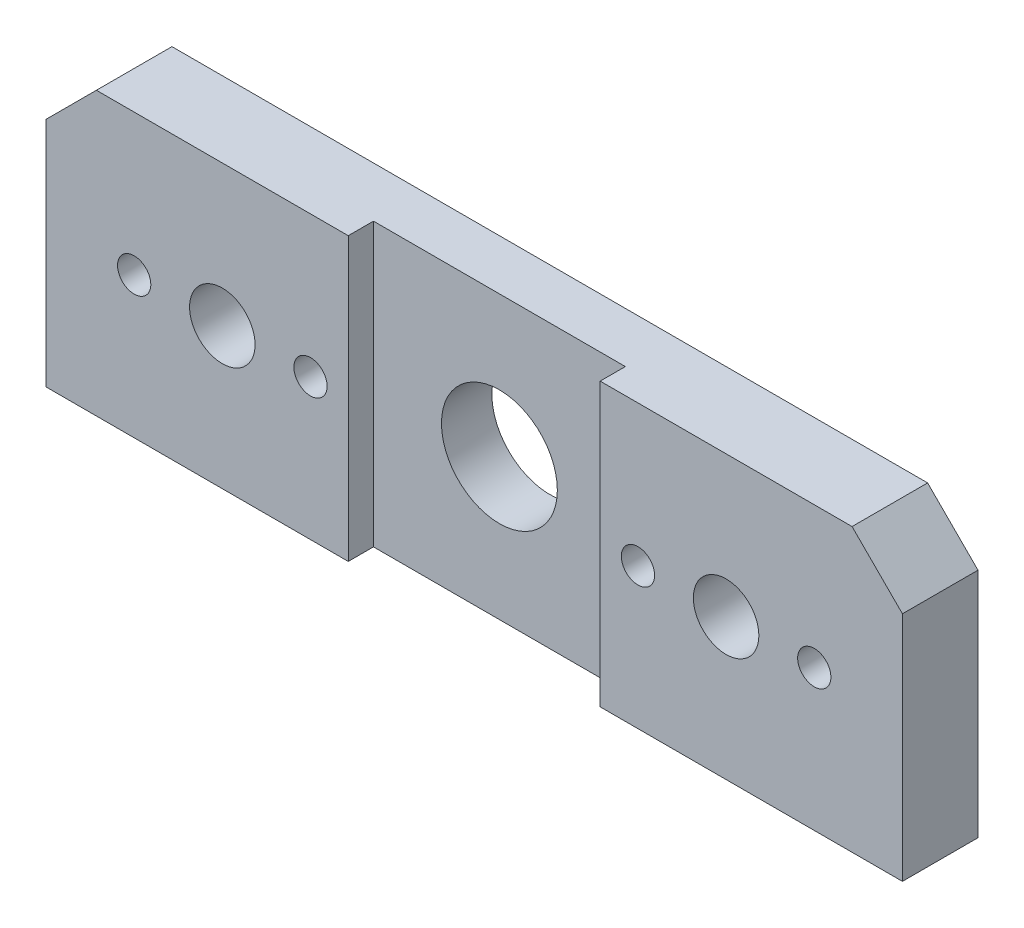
ISO-10303-21;
HEADER;
FILE_DESCRIPTION(('STEP AP214'),'2;1');
FILE_NAME('part.step','',(''),(''),'','','');
FILE_SCHEMA(('AUTOMOTIVE_DESIGN { 1 0 10303 214 1 1 1 1 }'));
ENDSEC;
DATA;
#1=APPLICATION_CONTEXT('core data for automotive mechanical design processes');
#2=APPLICATION_PROTOCOL_DEFINITION('international standard','automotive_design',2000,#1);
#3=PRODUCT_CONTEXT('',#1,'mechanical');
#4=PRODUCT('Part','Part','',(#3));
#5=PRODUCT_RELATED_PRODUCT_CATEGORY('part','',(#4));
#6=PRODUCT_DEFINITION_FORMATION('','',#4);
#7=PRODUCT_DEFINITION_CONTEXT('part definition',#1,'design');
#8=PRODUCT_DEFINITION('design','',#6,#7);
#9=PRODUCT_DEFINITION_SHAPE('','',#8);
#10=(LENGTH_UNIT() NAMED_UNIT(*) SI_UNIT(.MILLI.,.METRE.));
#11=(NAMED_UNIT(*) PLANE_ANGLE_UNIT() SI_UNIT($,.RADIAN.));
#12=(NAMED_UNIT(*) SI_UNIT($,.STERADIAN.) SOLID_ANGLE_UNIT());
#13=UNCERTAINTY_MEASURE_WITH_UNIT(LENGTH_MEASURE(1.E-05),#10,'distance_accuracy_value','');
#14=(GEOMETRIC_REPRESENTATION_CONTEXT(3) GLOBAL_UNCERTAINTY_ASSIGNED_CONTEXT((#13)) GLOBAL_UNIT_ASSIGNED_CONTEXT((#10,
#11,#12)) REPRESENTATION_CONTEXT('',''));
#15=CARTESIAN_POINT('',(0.,0.,0.));
#16=DIRECTION('',(0.,0.,1.));
#17=DIRECTION('',(1.,0.,0.));
#18=AXIS2_PLACEMENT_3D('',#15,#16,#17);
#19=CARTESIAN_POINT('',(-85.,56.,15.));
#20=DIRECTION('',(0.,0.,-1.));
#21=DIRECTION('',(-1.,0.,0.));
#22=AXIS2_PLACEMENT_3D('',#19,#20,#21);
#23=PLANE('',#22);
#24=CARTESIAN_POINT('',(-32.5,28.,15.));
#25=DIRECTION('',(0.,0.,-1.));
#26=DIRECTION('',(-1.,0.,0.));
#27=AXIS2_PLACEMENT_3D('',#24,#25,#26);
#28=CIRCLE('',#27,3.3);
#29=CARTESIAN_POINT('',(-35.8,28.,15.));
#30=VERTEX_POINT('',#29);
#31=EDGE_CURVE('E444',#30,#30,#28,.T.);
#32=ORIENTED_EDGE('',*,*,#31,.T.);
#33=EDGE_LOOP('',(#32));
#34=FACE_BOUND('',#33,.T.);
#35=CARTESIAN_POINT('',(-67.5,28.,15.));
#36=DIRECTION('',(0.,0.,-1.));
#37=DIRECTION('',(-1.,0.,0.));
#38=AXIS2_PLACEMENT_3D('',#35,#36,#37);
#39=CIRCLE('',#38,3.3);
#40=CARTESIAN_POINT('',(-70.8,28.,15.));
#41=VERTEX_POINT('',#40);
#42=EDGE_CURVE('E432',#41,#41,#39,.T.);
#43=ORIENTED_EDGE('',*,*,#42,.T.);
#44=EDGE_LOOP('',(#43));
#45=FACE_BOUND('',#44,.T.);
#46=CARTESIAN_POINT('',(-50.,28.,15.));
#47=DIRECTION('',(0.,0.,1.));
#48=DIRECTION('',(1.,0.,0.));
#49=AXIS2_PLACEMENT_3D('',#46,#47,#48);
#50=CIRCLE('',#49,6.5);
#51=CARTESIAN_POINT('',(-43.5,28.,15.));
#52=VERTEX_POINT('',#51);
#53=EDGE_CURVE('E418',#52,#52,#50,.T.);
#54=ORIENTED_EDGE('',*,*,#53,.F.);
#55=EDGE_LOOP('',(#54));
#56=FACE_BOUND('',#55,.T.);
#57=DIRECTION('',(1.,0.,0.));
#58=VECTOR('',#57,1.);
#59=CARTESIAN_POINT('',(-85.,0.,15.));
#60=LINE('',#59,#58);
#61=CARTESIAN_POINT('',(-85.,0.,15.));
#62=VERTEX_POINT('',#61);
#63=CARTESIAN_POINT('',(-25.,0.,15.));
#64=VERTEX_POINT('',#63);
#65=EDGE_CURVE('E386',#62,#64,#60,.T.);
#66=ORIENTED_EDGE('',*,*,#65,.T.);
#67=DIRECTION('',(0.,1.,0.));
#68=VECTOR('',#67,1.);
#69=CARTESIAN_POINT('',(-25.,56.,15.));
#70=LINE('',#69,#68);
#71=CARTESIAN_POINT('',(-25.,56.,15.));
#72=VERTEX_POINT('',#71);
#73=EDGE_CURVE('E228',#64,#72,#70,.T.);
#74=ORIENTED_EDGE('',*,*,#73,.T.);
#75=DIRECTION('',(-1.,0.,0.));
#76=VECTOR('',#75,1.);
#77=CARTESIAN_POINT('',(-85.,56.,15.));
#78=LINE('',#77,#76);
#79=CARTESIAN_POINT('',(-75.,56.,15.));
#80=VERTEX_POINT('',#79);
#81=EDGE_CURVE('E200',#72,#80,#78,.T.);
#82=ORIENTED_EDGE('',*,*,#81,.T.);
#83=DIRECTION('',(0.707106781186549,0.707106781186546,0.));
#84=VECTOR('',#83,1.);
#85=CARTESIAN_POINT('',(-85.,46.,15.));
#86=LINE('',#85,#84);
#87=CARTESIAN_POINT('',(-85.,46.,15.));
#88=VERTEX_POINT('',#87);
#89=EDGE_CURVE('E224',#80,#88,#86,.F.);
#90=ORIENTED_EDGE('',*,*,#89,.T.);
#91=DIRECTION('',(0.,-1.,0.));
#92=VECTOR('',#91,1.);
#93=CARTESIAN_POINT('',(-85.,0.,15.));
#94=LINE('',#93,#92);
#95=EDGE_CURVE('E384',#88,#62,#94,.T.);
#96=ORIENTED_EDGE('',*,*,#95,.T.);
#97=EDGE_LOOP('',(#66,#74,#82,#90,#96));
#98=FACE_BOUND('',#97,.T.);
#99=ADVANCED_FACE('F33',(#34,#45,#56,#98),#23,.F.);
#100=CARTESIAN_POINT('',(-85.,0.,15.));
#101=DIRECTION('',(1.,0.,0.));
#102=DIRECTION('',(0.,0.,-1.));
#103=AXIS2_PLACEMENT_3D('',#100,#101,#102);
#104=PLANE('',#103);
#105=ORIENTED_EDGE('',*,*,#95,.F.);
#106=DIRECTION('',(0.,0.,-1.));
#107=VECTOR('',#106,1.);
#108=CARTESIAN_POINT('',(-85.,46.,15.));
#109=LINE('',#108,#107);
#110=CARTESIAN_POINT('',(-85.,46.,0.));
#111=VERTEX_POINT('',#110);
#112=EDGE_CURVE('E211',#88,#111,#109,.T.);
#113=ORIENTED_EDGE('',*,*,#112,.T.);
#114=DIRECTION('',(0.,-1.,0.));
#115=VECTOR('',#114,1.);
#116=CARTESIAN_POINT('',(-85.,0.,0.));
#117=LINE('',#116,#115);
#118=CARTESIAN_POINT('',(-85.,0.,0.));
#119=VERTEX_POINT('',#118);
#120=EDGE_CURVE('E374',#111,#119,#117,.T.);
#121=ORIENTED_EDGE('',*,*,#120,.T.);
#122=DIRECTION('',(0.,0.,-1.));
#123=VECTOR('',#122,1.);
#124=CARTESIAN_POINT('',(-85.,0.,15.));
#125=LINE('',#124,#123);
#126=EDGE_CURVE('E203',#62,#119,#125,.T.);
#127=ORIENTED_EDGE('',*,*,#126,.F.);
#128=EDGE_LOOP('',(#105,#113,#121,#127));
#129=FACE_BOUND('',#128,.T.);
#130=ADVANCED_FACE('F35',(#129),#104,.F.);
#131=CARTESIAN_POINT('',(-85.,0.,15.));
#132=DIRECTION('',(0.,1.,0.));
#133=DIRECTION('',(0.,0.,1.));
#134=AXIS2_PLACEMENT_3D('',#131,#132,#133);
#135=PLANE('',#134);
#136=CARTESIAN_POINT('',(73.,0.,7.5));
#137=DIRECTION('',(0.,-1.,0.));
#138=DIRECTION('',(0.,0.,-1.));
#139=AXIS2_PLACEMENT_3D('',#136,#137,#138);
#140=CIRCLE('',#139,2.4);
#141=CARTESIAN_POINT('',(73.,0.,5.1));
#142=VERTEX_POINT('',#141);
#143=EDGE_CURVE('E339',#142,#142,#140,.T.);
#144=ORIENTED_EDGE('',*,*,#143,.F.);
#145=EDGE_LOOP('',(#144));
#146=FACE_BOUND('',#145,.T.);
#147=CARTESIAN_POINT('',(-73.,0.,7.49999999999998));
#148=DIRECTION('',(0.,-1.,0.));
#149=DIRECTION('',(0.,0.,-1.));
#150=AXIS2_PLACEMENT_3D('',#147,#148,#149);
#151=CIRCLE('',#150,2.4);
#152=CARTESIAN_POINT('',(-73.,0.,5.09999999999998));
#153=VERTEX_POINT('',#152);
#154=EDGE_CURVE('E321',#153,#153,#151,.T.);
#155=ORIENTED_EDGE('',*,*,#154,.F.);
#156=EDGE_LOOP('',(#155));
#157=FACE_BOUND('',#156,.T.);
#158=DIRECTION('',(1.,0.,0.));
#159=VECTOR('',#158,1.);
#160=CARTESIAN_POINT('',(-25.,0.,10.));
#161=LINE('',#160,#159);
#162=CARTESIAN_POINT('',(-25.,0.,10.));
#163=VERTEX_POINT('',#162);
#164=CARTESIAN_POINT('',(25.,0.,10.));
#165=VERTEX_POINT('',#164);
#166=EDGE_CURVE('E352',#163,#165,#161,.T.);
#167=ORIENTED_EDGE('',*,*,#166,.F.);
#168=DIRECTION('',(0.,0.,1.));
#169=VECTOR('',#168,1.);
#170=CARTESIAN_POINT('',(-25.,0.,10.));
#171=LINE('',#170,#169);
#172=EDGE_CURVE('E355',#163,#64,#171,.T.);
#173=ORIENTED_EDGE('',*,*,#172,.T.);
#174=ORIENTED_EDGE('',*,*,#65,.F.);
#175=ORIENTED_EDGE('',*,*,#126,.T.);
#176=DIRECTION('',(1.,0.,0.));
#177=VECTOR('',#176,1.);
#178=CARTESIAN_POINT('',(-85.,0.,0.));
#179=LINE('',#178,#177);
#180=CARTESIAN_POINT('',(85.,0.,0.));
#181=VERTEX_POINT('',#180);
#182=EDGE_CURVE('E376',#119,#181,#179,.T.);
#183=ORIENTED_EDGE('',*,*,#182,.T.);
#184=DIRECTION('',(0.,0.,-1.));
#185=VECTOR('',#184,1.);
#186=CARTESIAN_POINT('',(85.,0.,15.));
#187=LINE('',#186,#185);
#188=CARTESIAN_POINT('',(85.,0.,15.));
#189=VERTEX_POINT('',#188);
#190=EDGE_CURVE('E199',#189,#181,#187,.T.);
#191=ORIENTED_EDGE('',*,*,#190,.F.);
#192=CARTESIAN_POINT('',(25.,0.,15.));
#193=VERTEX_POINT('',#192);
#194=EDGE_CURVE('E385',#193,#189,#60,.T.);
#195=ORIENTED_EDGE('',*,*,#194,.F.);
#196=DIRECTION('',(0.,0.,1.));
#197=VECTOR('',#196,1.);
#198=CARTESIAN_POINT('',(25.,0.,10.));
#199=LINE('',#198,#197);
#200=EDGE_CURVE('E357',#165,#193,#199,.T.);
#201=ORIENTED_EDGE('',*,*,#200,.F.);
#202=EDGE_LOOP('',(#167,#173,#174,#175,#183,#191,#195,#201));
#203=FACE_BOUND('',#202,.T.);
#204=ADVANCED_FACE('F157',(#146,#157,#203),#135,.F.);
#205=CARTESIAN_POINT('',(85.,0.,15.));
#206=DIRECTION('',(-1.,0.,0.));
#207=DIRECTION('',(0.,-1.,0.));
#208=AXIS2_PLACEMENT_3D('',#205,#206,#207);
#209=PLANE('',#208);
#210=DIRECTION('',(0.,1.,0.));
#211=VECTOR('',#210,1.);
#212=CARTESIAN_POINT('',(85.,0.,0.));
#213=LINE('',#212,#211);
#214=CARTESIAN_POINT('',(85.,46.,0.));
#215=VERTEX_POINT('',#214);
#216=EDGE_CURVE('E378',#181,#215,#213,.T.);
#217=ORIENTED_EDGE('',*,*,#216,.T.);
#218=DIRECTION('',(0.,0.,1.));
#219=VECTOR('',#218,1.);
#220=CARTESIAN_POINT('',(85.,46.,15.));
#221=LINE('',#220,#219);
#222=CARTESIAN_POINT('',(85.,46.,15.));
#223=VERTEX_POINT('',#222);
#224=EDGE_CURVE('E226',#215,#223,#221,.T.);
#225=ORIENTED_EDGE('',*,*,#224,.T.);
#226=DIRECTION('',(0.,1.,0.));
#227=VECTOR('',#226,1.);
#228=CARTESIAN_POINT('',(85.,0.,15.));
#229=LINE('',#228,#227);
#230=EDGE_CURVE('E205',#189,#223,#229,.T.);
#231=ORIENTED_EDGE('',*,*,#230,.F.);
#232=ORIENTED_EDGE('',*,*,#190,.T.);
#233=EDGE_LOOP('',(#217,#225,#231,#232));
#234=FACE_BOUND('',#233,.T.);
#235=ADVANCED_FACE('F173',(#234),#209,.F.);
#236=CARTESIAN_POINT('',(-85.,56.,15.));
#237=DIRECTION('',(0.,-1.,0.));
#238=DIRECTION('',(0.,0.,-1.));
#239=AXIS2_PLACEMENT_3D('',#236,#237,#238);
#240=PLANE('',#239);
#241=ORIENTED_EDGE('',*,*,#81,.F.);
#242=DIRECTION('',(0.,0.,-1.));
#243=VECTOR('',#242,1.);
#244=CARTESIAN_POINT('',(-25.,56.,15.));
#245=LINE('',#244,#243);
#246=CARTESIAN_POINT('',(-25.,56.,10.));
#247=VERTEX_POINT('',#246);
#248=EDGE_CURVE('E371',#72,#247,#245,.T.);
#249=ORIENTED_EDGE('',*,*,#248,.T.);
#250=DIRECTION('',(1.,0.,0.));
#251=VECTOR('',#250,1.);
#252=CARTESIAN_POINT('',(-85.,56.,10.));
#253=LINE('',#252,#251);
#254=CARTESIAN_POINT('',(25.,56.,10.));
#255=VERTEX_POINT('',#254);
#256=EDGE_CURVE('E231',#247,#255,#253,.T.);
#257=ORIENTED_EDGE('',*,*,#256,.T.);
#258=DIRECTION('',(0.,0.,1.));
#259=VECTOR('',#258,1.);
#260=CARTESIAN_POINT('',(25.,56.,15.));
#261=LINE('',#260,#259);
#262=CARTESIAN_POINT('',(25.,56.,15.));
#263=VERTEX_POINT('',#262);
#264=EDGE_CURVE('E368',#255,#263,#261,.T.);
#265=ORIENTED_EDGE('',*,*,#264,.T.);
#266=CARTESIAN_POINT('',(75.,56.,15.));
#267=VERTEX_POINT('',#266);
#268=EDGE_CURVE('E190',#267,#263,#78,.T.);
#269=ORIENTED_EDGE('',*,*,#268,.F.);
#270=DIRECTION('',(0.,0.,-1.));
#271=VECTOR('',#270,1.);
#272=CARTESIAN_POINT('',(75.,56.,15.));
#273=LINE('',#272,#271);
#274=CARTESIAN_POINT('',(75.,56.,0.));
#275=VERTEX_POINT('',#274);
#276=EDGE_CURVE('E218',#267,#275,#273,.T.);
#277=ORIENTED_EDGE('',*,*,#276,.T.);
#278=DIRECTION('',(-1.,0.,0.));
#279=VECTOR('',#278,1.);
#280=CARTESIAN_POINT('',(-85.,56.,0.));
#281=LINE('',#280,#279);
#282=CARTESIAN_POINT('',(-75.,56.,0.));
#283=VERTEX_POINT('',#282);
#284=EDGE_CURVE('E381',#275,#283,#281,.T.);
#285=ORIENTED_EDGE('',*,*,#284,.T.);
#286=DIRECTION('',(0.,0.,1.));
#287=VECTOR('',#286,1.);
#288=CARTESIAN_POINT('',(-75.,56.,15.));
#289=LINE('',#288,#287);
#290=EDGE_CURVE('E220',#283,#80,#289,.T.);
#291=ORIENTED_EDGE('',*,*,#290,.T.);
#292=EDGE_LOOP('',(#241,#249,#257,#265,#269,#277,#285,#291));
#293=FACE_BOUND('',#292,.T.);
#294=ADVANCED_FACE('F165',(#293),#240,.F.);
#295=CARTESIAN_POINT('',(32.5,28.,15.));
#296=DIRECTION('',(0.,0.,-1.));
#297=DIRECTION('',(-1.,0.,0.));
#298=AXIS2_PLACEMENT_3D('',#295,#296,#297);
#299=CIRCLE('',#298,3.3);
#300=CARTESIAN_POINT('',(29.2,28.,15.));
#301=VERTEX_POINT('',#300);
#302=EDGE_CURVE('E178',#301,#301,#299,.T.);
#303=ORIENTED_EDGE('',*,*,#302,.T.);
#304=EDGE_LOOP('',(#303));
#305=FACE_BOUND('',#304,.T.);
#306=CARTESIAN_POINT('',(67.5,28.,15.));
#307=DIRECTION('',(0.,0.,-1.));
#308=DIRECTION('',(-1.,0.,0.));
#309=AXIS2_PLACEMENT_3D('',#306,#307,#308);
#310=CIRCLE('',#309,3.3);
#311=CARTESIAN_POINT('',(64.2,28.,15.));
#312=VERTEX_POINT('',#311);
#313=EDGE_CURVE('E182',#312,#312,#310,.T.);
#314=ORIENTED_EDGE('',*,*,#313,.T.);
#315=EDGE_LOOP('',(#314));
#316=FACE_BOUND('',#315,.T.);
#317=CARTESIAN_POINT('',(50.,28.,15.));
#318=DIRECTION('',(0.,0.,1.));
#319=DIRECTION('',(1.,0.,0.));
#320=AXIS2_PLACEMENT_3D('',#317,#318,#319);
#321=CIRCLE('',#320,6.5);
#322=CARTESIAN_POINT('',(56.5,28.,15.));
#323=VERTEX_POINT('',#322);
#324=EDGE_CURVE('E186',#323,#323,#321,.T.);
#325=ORIENTED_EDGE('',*,*,#324,.F.);
#326=EDGE_LOOP('',(#325));
#327=FACE_BOUND('',#326,.T.);
#328=ORIENTED_EDGE('',*,*,#268,.T.);
#329=DIRECTION('',(0.,1.,0.));
#330=VECTOR('',#329,1.);
#331=CARTESIAN_POINT('',(25.,0.,15.));
#332=LINE('',#331,#330);
#333=EDGE_CURVE('E191',#193,#263,#332,.T.);
#334=ORIENTED_EDGE('',*,*,#333,.F.);
#335=ORIENTED_EDGE('',*,*,#194,.T.);
#336=ORIENTED_EDGE('',*,*,#230,.T.);
#337=DIRECTION('',(0.707106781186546,-0.707106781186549,0.));
#338=VECTOR('',#337,1.);
#339=CARTESIAN_POINT('',(75.,56.,15.));
#340=LINE('',#339,#338);
#341=EDGE_CURVE('E195',#223,#267,#340,.F.);
#342=ORIENTED_EDGE('',*,*,#341,.T.);
#343=EDGE_LOOP('',(#328,#334,#335,#336,#342));
#344=FACE_BOUND('',#343,.T.);
#345=ADVANCED_FACE('F153',(#305,#316,#327,#344),#23,.F.);
#346=CARTESIAN_POINT('',(-85.,56.,0.));
#347=DIRECTION('',(0.,0.,-1.));
#348=DIRECTION('',(-1.,0.,0.));
#349=AXIS2_PLACEMENT_3D('',#346,#347,#348);
#350=PLANE('',#349);
#351=CARTESIAN_POINT('',(32.5,28.,0.));
#352=DIRECTION('',(0.,0.,-1.));
#353=DIRECTION('',(-1.,0.,0.));
#354=AXIS2_PLACEMENT_3D('',#351,#352,#353);
#355=CIRCLE('',#354,6.);
#356=CARTESIAN_POINT('',(26.5,28.,0.));
#357=VERTEX_POINT('',#356);
#358=EDGE_CURVE('E455',#357,#357,#355,.T.);
#359=ORIENTED_EDGE('',*,*,#358,.F.);
#360=EDGE_LOOP('',(#359));
#361=FACE_BOUND('',#360,.T.);
#362=CARTESIAN_POINT('',(67.5,28.,0.));
#363=DIRECTION('',(0.,0.,-1.));
#364=DIRECTION('',(-1.,0.,0.));
#365=AXIS2_PLACEMENT_3D('',#362,#363,#364);
#366=CIRCLE('',#365,6.00000000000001);
#367=CARTESIAN_POINT('',(61.5,28.,0.));
#368=VERTEX_POINT('',#367);
#369=EDGE_CURVE('E446',#368,#368,#366,.T.);
#370=ORIENTED_EDGE('',*,*,#369,.F.);
#371=EDGE_LOOP('',(#370));
#372=FACE_BOUND('',#371,.T.);
#373=CARTESIAN_POINT('',(-32.5,28.,0.));
#374=DIRECTION('',(0.,0.,-1.));
#375=DIRECTION('',(-1.,0.,0.));
#376=AXIS2_PLACEMENT_3D('',#373,#374,#375);
#377=CIRCLE('',#376,6.);
#378=CARTESIAN_POINT('',(-38.5,28.,0.));
#379=VERTEX_POINT('',#378);
#380=EDGE_CURVE('E435',#379,#379,#377,.T.);
#381=ORIENTED_EDGE('',*,*,#380,.F.);
#382=EDGE_LOOP('',(#381));
#383=FACE_BOUND('',#382,.T.);
#384=CARTESIAN_POINT('',(-67.5,28.,0.));
#385=DIRECTION('',(0.,0.,-1.));
#386=DIRECTION('',(-1.,0.,0.));
#387=AXIS2_PLACEMENT_3D('',#384,#385,#386);
#388=CIRCLE('',#387,6.);
#389=CARTESIAN_POINT('',(-73.5,28.,0.));
#390=VERTEX_POINT('',#389);
#391=EDGE_CURVE('E425',#390,#390,#388,.T.);
#392=ORIENTED_EDGE('',*,*,#391,.F.);
#393=EDGE_LOOP('',(#392));
#394=FACE_BOUND('',#393,.T.);
#395=CARTESIAN_POINT('',(50.,28.,0.));
#396=DIRECTION('',(0.,0.,1.));
#397=DIRECTION('',(1.,0.,0.));
#398=AXIS2_PLACEMENT_3D('',#395,#396,#397);
#399=CIRCLE('',#398,6.5);
#400=CARTESIAN_POINT('',(56.5,28.,0.));
#401=VERTEX_POINT('',#400);
#402=EDGE_CURVE('E421',#401,#401,#399,.T.);
#403=ORIENTED_EDGE('',*,*,#402,.T.);
#404=EDGE_LOOP('',(#403));
#405=FACE_BOUND('',#404,.T.);
#406=CARTESIAN_POINT('',(-50.,28.,0.));
#407=DIRECTION('',(0.,0.,1.));
#408=DIRECTION('',(1.,0.,0.));
#409=AXIS2_PLACEMENT_3D('',#406,#407,#408);
#410=CIRCLE('',#409,6.5);
#411=CARTESIAN_POINT('',(-43.5,28.,0.));
#412=VERTEX_POINT('',#411);
#413=EDGE_CURVE('E415',#412,#412,#410,.T.);
#414=ORIENTED_EDGE('',*,*,#413,.T.);
#415=EDGE_LOOP('',(#414));
#416=FACE_BOUND('',#415,.T.);
#417=CARTESIAN_POINT('',(0.,28.,0.));
#418=DIRECTION('',(0.,0.,1.));
#419=DIRECTION('',(1.,0.,0.));
#420=AXIS2_PLACEMENT_3D('',#417,#418,#419);
#421=CIRCLE('',#420,11.5);
#422=CARTESIAN_POINT('',(11.5,28.,0.));
#423=VERTEX_POINT('',#422);
#424=EDGE_CURVE('E238',#423,#423,#421,.T.);
#425=ORIENTED_EDGE('',*,*,#424,.T.);
#426=EDGE_LOOP('',(#425));
#427=FACE_BOUND('',#426,.T.);
#428=ORIENTED_EDGE('',*,*,#120,.F.);
#429=DIRECTION('',(-0.707106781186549,-0.707106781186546,0.));
#430=VECTOR('',#429,1.);
#431=CARTESIAN_POINT('',(-80.,51.,0.));
#432=LINE('',#431,#430);
#433=EDGE_CURVE('E216',#111,#283,#432,.F.);
#434=ORIENTED_EDGE('',*,*,#433,.T.);
#435=ORIENTED_EDGE('',*,*,#284,.F.);
#436=DIRECTION('',(-0.707106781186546,0.707106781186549,0.));
#437=VECTOR('',#436,1.);
#438=CARTESIAN_POINT('',(-4.9999999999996,136.,0.));
#439=LINE('',#438,#437);
#440=EDGE_CURVE('E214',#275,#215,#439,.F.);
#441=ORIENTED_EDGE('',*,*,#440,.T.);
#442=ORIENTED_EDGE('',*,*,#216,.F.);
#443=ORIENTED_EDGE('',*,*,#182,.F.);
#444=EDGE_LOOP('',(#428,#434,#435,#441,#442,#443));
#445=FACE_BOUND('',#444,.T.);
#446=ADVANCED_FACE('F164',(#361,#372,#383,#394,#405,#416,#427,#445),#350,.T.);
#447=CARTESIAN_POINT('',(-85.,46.,15.));
#448=DIRECTION('',(0.707106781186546,-0.707106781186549,0.));
#449=DIRECTION('',(0.707106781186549,0.707106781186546,0.));
#450=AXIS2_PLACEMENT_3D('',#447,#448,#449);
#451=PLANE('',#450);
#452=ORIENTED_EDGE('',*,*,#89,.F.);
#453=ORIENTED_EDGE('',*,*,#290,.F.);
#454=ORIENTED_EDGE('',*,*,#433,.F.);
#455=ORIENTED_EDGE('',*,*,#112,.F.);
#456=EDGE_LOOP('',(#452,#453,#454,#455));
#457=FACE_BOUND('',#456,.T.);
#458=ADVANCED_FACE('F171',(#457),#451,.F.);
#459=CARTESIAN_POINT('',(75.,56.,15.));
#460=DIRECTION('',(-0.707106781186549,-0.707106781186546,0.));
#461=DIRECTION('',(0.707106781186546,-0.707106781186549,0.));
#462=AXIS2_PLACEMENT_3D('',#459,#460,#461);
#463=PLANE('',#462);
#464=ORIENTED_EDGE('',*,*,#341,.F.);
#465=ORIENTED_EDGE('',*,*,#224,.F.);
#466=ORIENTED_EDGE('',*,*,#440,.F.);
#467=ORIENTED_EDGE('',*,*,#276,.F.);
#468=EDGE_LOOP('',(#464,#465,#466,#467));
#469=FACE_BOUND('',#468,.T.);
#470=ADVANCED_FACE('F395',(#469),#463,.F.);
#471=CARTESIAN_POINT('',(-25.,84.0864618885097,10.));
#472=DIRECTION('',(0.,0.,-1.));
#473=DIRECTION('',(-1.,0.,0.));
#474=AXIS2_PLACEMENT_3D('',#471,#472,#473);
#475=PLANE('',#474);
#476=CARTESIAN_POINT('',(0.,28.,10.));
#477=DIRECTION('',(0.,0.,-1.));
#478=DIRECTION('',(-1.,0.,0.));
#479=AXIS2_PLACEMENT_3D('',#476,#477,#478);
#480=CIRCLE('',#479,11.5);
#481=CARTESIAN_POINT('',(-11.5,28.,10.));
#482=VERTEX_POINT('',#481);
#483=EDGE_CURVE('E235',#482,#482,#480,.T.);
#484=ORIENTED_EDGE('',*,*,#483,.T.);
#485=EDGE_LOOP('',(#484));
#486=FACE_BOUND('',#485,.T.);
#487=DIRECTION('',(0.,-1.,0.));
#488=VECTOR('',#487,1.);
#489=CARTESIAN_POINT('',(-25.,0.,10.));
#490=LINE('',#489,#488);
#491=EDGE_CURVE('E361',#247,#163,#490,.T.);
#492=ORIENTED_EDGE('',*,*,#491,.T.);
#493=ORIENTED_EDGE('',*,*,#166,.T.);
#494=DIRECTION('',(0.,1.,0.));
#495=VECTOR('',#494,1.);
#496=CARTESIAN_POINT('',(25.,0.,10.));
#497=LINE('',#496,#495);
#498=EDGE_CURVE('E360',#165,#255,#497,.T.);
#499=ORIENTED_EDGE('',*,*,#498,.T.);
#500=ORIENTED_EDGE('',*,*,#256,.F.);
#501=EDGE_LOOP('',(#492,#493,#499,#500));
#502=FACE_BOUND('',#501,.T.);
#503=ADVANCED_FACE('F409',(#486,#502),#475,.F.);
#504=CARTESIAN_POINT('',(-25.,0.,10.));
#505=DIRECTION('',(-1.,0.,0.));
#506=DIRECTION('',(0.,0.,1.));
#507=AXIS2_PLACEMENT_3D('',#504,#505,#506);
#508=PLANE('',#507);
#509=ORIENTED_EDGE('',*,*,#73,.F.);
#510=ORIENTED_EDGE('',*,*,#172,.F.);
#511=ORIENTED_EDGE('',*,*,#491,.F.);
#512=ORIENTED_EDGE('',*,*,#248,.F.);
#513=EDGE_LOOP('',(#509,#510,#511,#512));
#514=FACE_BOUND('',#513,.T.);
#515=ADVANCED_FACE('F408',(#514),#508,.F.);
#516=CARTESIAN_POINT('',(25.,0.,10.));
#517=DIRECTION('',(1.,0.,0.));
#518=DIRECTION('',(0.,1.,0.));
#519=AXIS2_PLACEMENT_3D('',#516,#517,#518);
#520=PLANE('',#519);
#521=ORIENTED_EDGE('',*,*,#498,.F.);
#522=ORIENTED_EDGE('',*,*,#200,.T.);
#523=ORIENTED_EDGE('',*,*,#333,.T.);
#524=ORIENTED_EDGE('',*,*,#264,.F.);
#525=EDGE_LOOP('',(#521,#522,#523,#524));
#526=FACE_BOUND('',#525,.T.);
#527=ADVANCED_FACE('F411',(#526),#520,.F.);
#528=CARTESIAN_POINT('',(0.,28.,0.));
#529=DIRECTION('',(0.,0.,1.));
#530=DIRECTION('',(1.,0.,0.));
#531=AXIS2_PLACEMENT_3D('',#528,#529,#530);
#532=CYLINDRICAL_SURFACE('',#531,11.5);
#533=ORIENTED_EDGE('',*,*,#424,.F.);
#534=EDGE_LOOP('',(#533));
#535=FACE_BOUND('',#534,.T.);
#536=ORIENTED_EDGE('',*,*,#483,.F.);
#537=EDGE_LOOP('',(#536));
#538=FACE_BOUND('',#537,.T.);
#539=ADVANCED_FACE('F481',(#535,#538),#532,.F.);
#540=CARTESIAN_POINT('',(-50.,28.,0.));
#541=DIRECTION('',(0.,0.,1.));
#542=DIRECTION('',(1.,0.,0.));
#543=AXIS2_PLACEMENT_3D('',#540,#541,#542);
#544=CYLINDRICAL_SURFACE('',#543,6.5);
#545=ORIENTED_EDGE('',*,*,#413,.F.);
#546=EDGE_LOOP('',(#545));
#547=FACE_BOUND('',#546,.T.);
#548=ORIENTED_EDGE('',*,*,#53,.T.);
#549=EDGE_LOOP('',(#548));
#550=FACE_BOUND('',#549,.T.);
#551=ADVANCED_FACE('F484',(#547,#550),#544,.F.);
#552=CARTESIAN_POINT('',(50.,28.,0.));
#553=DIRECTION('',(0.,0.,1.));
#554=DIRECTION('',(1.,0.,0.));
#555=AXIS2_PLACEMENT_3D('',#552,#553,#554);
#556=CYLINDRICAL_SURFACE('',#555,6.5);
#557=ORIENTED_EDGE('',*,*,#402,.F.);
#558=EDGE_LOOP('',(#557));
#559=FACE_BOUND('',#558,.T.);
#560=ORIENTED_EDGE('',*,*,#324,.T.);
#561=EDGE_LOOP('',(#560));
#562=FACE_BOUND('',#561,.T.);
#563=ADVANCED_FACE('F260',(#559,#562),#556,.F.);
#564=CARTESIAN_POINT('',(-67.5,28.,0.));
#565=DIRECTION('',(0.,0.,-1.));
#566=DIRECTION('',(-1.,0.,0.));
#567=AXIS2_PLACEMENT_3D('',#564,#565,#566);
#568=CYLINDRICAL_SURFACE('',#567,6.);
#569=CARTESIAN_POINT('',(-71.4797475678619,23.5098319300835,7.19020000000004));
#570=CARTESIAN_POINT('',(-71.4670544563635,23.4985778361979,7.15880173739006));
#571=CARTESIAN_POINT('',(-71.4529729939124,23.4861964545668,7.12845375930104));
#572=CARTESIAN_POINT('',(-71.4225549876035,23.4597404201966,7.06980220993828));
#573=CARTESIAN_POINT('',(-71.4062250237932,23.4456707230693,7.04149302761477));
#574=CARTESIAN_POINT('',(-71.3717385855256,23.4163162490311,6.98666100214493));
#575=CARTESIAN_POINT('',(-71.3535805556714,23.4010304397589,6.96013971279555));
#576=CARTESIAN_POINT('',(-71.3156989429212,23.3695518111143,6.90877282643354));
#577=CARTESIAN_POINT('',(-71.2959737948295,23.3533580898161,6.88392895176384));
#578=CARTESIAN_POINT('',(-71.2165094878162,23.2890228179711,6.79026353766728));
#579=CARTESIAN_POINT('',(-71.1517416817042,23.2384620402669,6.72726788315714));
#580=CARTESIAN_POINT('',(-71.0128042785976,23.1350494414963,6.61499598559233));
#581=CARTESIAN_POINT('',(-70.9386335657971,23.0821973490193,6.56572137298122));
#582=CARTESIAN_POINT('',(-70.8171472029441,23.0000776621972,6.50273724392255));
#583=CARTESIAN_POINT('',(-70.7728506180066,22.970950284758,6.48302023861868));
#584=CARTESIAN_POINT('',(-70.6820166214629,22.912988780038,6.44976098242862));
#585=CARTESIAN_POINT('',(-70.6354855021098,22.8841540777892,6.4362024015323));
#586=CARTESIAN_POINT('',(-70.5878926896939,22.8555934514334,6.42617696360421));
#587=B_SPLINE_CURVE_WITH_KNOTS('',3,(#569,#570,#571,#572,#573,#574,#575,#576,#577,#578,#579,
#580,#581,#582,#583,#584,#585,#586),.UNSPECIFIED.,.F.,.F.,(4,2,2,2,2,2,2,2,4),(0.,
0.106895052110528,0.213483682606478,0.320163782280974,0.426951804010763,0.735993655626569,
1.04507221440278,1.2144151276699,1.38330634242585),.UNSPECIFIED.);
#588=CARTESIAN_POINT('',(-71.3799977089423,23.423361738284,7.));
#589=VERTEX_POINT('',#588);
#590=CARTESIAN_POINT('',(-70.8166247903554,23.,6.50357002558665));
#591=VERTEX_POINT('',#590);
#592=EDGE_CURVE('E56',#589,#591,#587,.T.);
#593=ORIENTED_EDGE('',*,*,#592,.T.);
#594=CARTESIAN_POINT('',(-70.8166247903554,23.,6.50357002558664));
#595=CARTESIAN_POINT('',(-70.7987500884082,22.9881444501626,6.54272915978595));
#596=CARTESIAN_POINT('',(-70.7818453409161,22.9770679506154,6.58256813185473));
#597=CARTESIAN_POINT('',(-70.7501610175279,22.9565080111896,6.66328453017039));
#598=CARTESIAN_POINT('',(-70.7353730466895,22.9470182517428,6.70415705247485));
#599=CARTESIAN_POINT('',(-70.7079594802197,22.9295699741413,6.78694217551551));
#600=CARTESIAN_POINT('',(-70.6953339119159,22.9216114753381,6.82885478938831));
#601=CARTESIAN_POINT('',(-70.6722915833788,22.9071867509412,6.91372463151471));
#602=CARTESIAN_POINT('',(-70.6618840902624,22.9007267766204,6.9566854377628));
#603=CARTESIAN_POINT('',(-70.6526610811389,22.895029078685,7.));
#604=B_SPLINE_CURVE_WITH_KNOTS('',3,(#594,#595,#596,#597,#598,#599,#600,#601,#602,#603),
.UNSPECIFIED.,.F.,.F.,(4,2,2,2,4),(0.,0.133925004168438,0.267303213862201,0.400683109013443,
0.534609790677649),.UNSPECIFIED.);
#605=CARTESIAN_POINT('',(-70.6526610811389,22.895029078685,7.));
#606=VERTEX_POINT('',#605);
#607=EDGE_CURVE('E270',#591,#606,#604,.T.);
#608=ORIENTED_EDGE('',*,*,#607,.T.);
#609=CARTESIAN_POINT('',(-67.5,28.,7.));
#610=DIRECTION('',(0.,0.,-1.));
#611=DIRECTION('',(-1.,0.,0.));
#612=AXIS2_PLACEMENT_3D('',#609,#610,#611);
#613=CIRCLE('',#612,6.);
#614=EDGE_CURVE('E316',#589,#606,#613,.T.);
#615=ORIENTED_EDGE('',*,*,#614,.F.);
#616=EDGE_LOOP('',(#593,#608,#615));
#617=FACE_BOUND('',#616,.T.);
#618=ORIENTED_EDGE('',*,*,#391,.T.);
#619=EDGE_LOOP('',(#618));
#620=FACE_BOUND('',#619,.T.);
#621=ADVANCED_FACE('F254',(#617,#620),#568,.F.);
#622=CARTESIAN_POINT('',(-64.2,28.,7.));
#623=DIRECTION('',(0.,0.,1.));
#624=DIRECTION('',(1.,0.,0.));
#625=AXIS2_PLACEMENT_3D('',#622,#623,#624);
#626=PLANE('',#625);
#627=CARTESIAN_POINT('',(-67.5,28.,7.));
#628=DIRECTION('',(0.,0.,-1.));
#629=DIRECTION('',(-1.,0.,0.));
#630=AXIS2_PLACEMENT_3D('',#627,#628,#629);
#631=CIRCLE('',#630,3.3);
#632=CARTESIAN_POINT('',(-70.8,28.,7.));
#633=VERTEX_POINT('',#632);
#634=EDGE_CURVE('E429',#633,#633,#631,.T.);
#635=ORIENTED_EDGE('',*,*,#634,.F.);
#636=EDGE_LOOP('',(#635));
#637=FACE_BOUND('',#636,.T.);
#638=ORIENTED_EDGE('',*,*,#614,.T.);
#639=DIRECTION('',(0.,-1.,0.));
#640=VECTOR('',#639,1.);
#641=CARTESIAN_POINT('',(-70.6526610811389,0.,7.));
#642=LINE('',#641,#640);
#643=CARTESIAN_POINT('',(-70.6526610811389,23.,7.));
#644=VERTEX_POINT('',#643);
#645=EDGE_CURVE('E245',#606,#644,#642,.F.);
#646=ORIENTED_EDGE('',*,*,#645,.T.);
#647=CARTESIAN_POINT('',(-76.5261394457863,22.3021529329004,7.));
#648=CARTESIAN_POINT('',(-76.4283033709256,22.3603546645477,7.));
#649=CARTESIAN_POINT('',(-76.3304479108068,22.4185238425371,7.));
#650=CARTESIAN_POINT('',(-76.1346444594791,22.5347927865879,7.));
#651=CARTESIAN_POINT('',(-76.036696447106,22.592892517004,7.));
#652=CARTESIAN_POINT('',(-75.8400853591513,22.7093549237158,7.));
#653=CARTESIAN_POINT('',(-75.7414218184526,22.7677168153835,7.));
#654=CARTESIAN_POINT('',(-75.5440339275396,22.8842507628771,7.));
#655=CARTESIAN_POINT('',(-75.4453096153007,22.9424228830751,7.));
#656=CARTESIAN_POINT('',(-75.1891974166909,23.0929392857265,7.));
#657=CARTESIAN_POINT('',(-75.0317071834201,23.1851100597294,7.));
#658=CARTESIAN_POINT('',(-74.7948729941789,23.3225980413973,7.));
#659=CARTESIAN_POINT('',(-74.7157711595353,23.3683320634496,7.));
#660=CARTESIAN_POINT('',(-74.5573395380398,23.4593756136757,7.));
#661=CARTESIAN_POINT('',(-74.4780097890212,23.5046852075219,7.));
#662=CARTESIAN_POINT('',(-74.3194281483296,23.594408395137,7.));
#663=CARTESIAN_POINT('',(-74.2401782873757,23.6388255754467,7.));
#664=CARTESIAN_POINT('',(-74.0810516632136,23.7266477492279,7.));
#665=CARTESIAN_POINT('',(-74.0011745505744,23.7700521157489,7.));
#666=CARTESIAN_POINT('',(-73.8807028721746,23.8336571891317,7.));
#667=CARTESIAN_POINT('',(-73.8404912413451,23.8545812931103,7.));
#668=CARTESIAN_POINT('',(-73.7597183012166,23.8957413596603,7.));
#669=CARTESIAN_POINT('',(-73.7191570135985,23.915977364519,7.));
#670=CARTESIAN_POINT('',(-73.6375886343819,23.9554300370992,7.));
#671=CARTESIAN_POINT('',(-73.5965820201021,23.9746476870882,7.));
#672=CARTESIAN_POINT('',(-73.5138973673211,24.0115706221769,7.));
#673=CARTESIAN_POINT('',(-73.4722195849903,24.0292764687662,7.));
#674=CARTESIAN_POINT('',(-73.4125279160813,24.0526610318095,7.));
#675=CARTESIAN_POINT('',(-73.3949021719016,24.0593271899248,7.));
#676=CARTESIAN_POINT('',(-73.3594651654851,24.0721505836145,7.));
#677=CARTESIAN_POINT('',(-73.3416538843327,24.078307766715,7.));
#678=CARTESIAN_POINT('',(-73.2879285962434,24.0958545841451,7.));
#679=CARTESIAN_POINT('',(-73.2517027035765,24.1063277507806,7.));
#680=CARTESIAN_POINT('',(-73.1798738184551,24.1233736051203,7.));
#681=CARTESIAN_POINT('',(-73.1443057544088,24.1300880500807,7.));
#682=CARTESIAN_POINT('',(-73.0726134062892,24.1392083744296,7.));
#683=CARTESIAN_POINT('',(-73.0364895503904,24.1416174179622,7.));
#684=CARTESIAN_POINT('',(-72.9668640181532,24.1416514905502,7.));
#685=CARTESIAN_POINT('',(-72.9333621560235,24.1396107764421,7.));
#686=CARTESIAN_POINT('',(-72.8668008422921,24.1317793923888,7.));
#687=CARTESIAN_POINT('',(-72.833741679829,24.1259863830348,7.));
#688=CARTESIAN_POINT('',(-72.7676878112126,24.1113165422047,7.));
#689=CARTESIAN_POINT('',(-72.7347060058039,24.1023837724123,7.));
#690=CARTESIAN_POINT('',(-72.6694368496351,24.0823067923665,7.));
#691=CARTESIAN_POINT('',(-72.6371495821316,24.0711623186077,7.));
#692=CARTESIAN_POINT('',(-72.5462335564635,24.0373243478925,7.));
#693=CARTESIAN_POINT('',(-72.488296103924,24.012802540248,7.));
#694=CARTESIAN_POINT('',(-72.3736399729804,23.9610316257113,7.));
#695=CARTESIAN_POINT('',(-72.316922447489,23.9337800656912,7.));
#696=CARTESIAN_POINT('',(-72.2041586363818,23.8776504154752,7.));
#697=CARTESIAN_POINT('',(-72.1481139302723,23.8487691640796,7.));
#698=CARTESIAN_POINT('',(-72.0365587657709,23.7900554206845,7.));
#699=CARTESIAN_POINT('',(-71.9810481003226,23.7602233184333,7.));
#700=CARTESIAN_POINT('',(-71.8704016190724,23.6999480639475,7.));
#701=CARTESIAN_POINT('',(-71.8152656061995,23.669505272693,7.));
#702=CARTESIAN_POINT('',(-71.7052287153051,23.6081859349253,7.));
#703=CARTESIAN_POINT('',(-71.6503278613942,23.5773093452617,7.));
#704=CARTESIAN_POINT('',(-71.4860355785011,23.4843150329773,7.));
#705=CARTESIAN_POINT('',(-71.3768992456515,23.4217471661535,7.));
#706=CARTESIAN_POINT('',(-71.1508242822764,23.2912305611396,7.));
#707=CARTESIAN_POINT('',(-71.0339153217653,23.2232306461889,7.));
#708=CARTESIAN_POINT('',(-70.8003643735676,23.0867734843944,7.));
#709=CARTESIAN_POINT('',(-70.6837223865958,23.0183162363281,7.));
#710=CARTESIAN_POINT('',(-70.3340413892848,22.8125150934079,7.));
#711=CARTESIAN_POINT('',(-70.101253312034,22.6747452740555,7.));
#712=CARTESIAN_POINT('',(-69.6358385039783,22.3985829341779,7.));
#713=CARTESIAN_POINT('',(-69.4032119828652,22.2601900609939,7.));
#714=CARTESIAN_POINT('',(-68.9381431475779,21.9831009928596,7.));
#715=CARTESIAN_POINT('',(-68.7057008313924,21.8444048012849,7.));
#716=CARTESIAN_POINT('',(-68.245149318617,21.5693493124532,7.));
#717=CARTESIAN_POINT('',(-68.0170381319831,21.4329933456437,7.));
#718=CARTESIAN_POINT('',(-67.5608858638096,21.1601622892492,7.));
#719=CARTESIAN_POINT('',(-67.3328447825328,21.0236871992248,7.));
#720=CARTESIAN_POINT('',(-66.8769723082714,20.7507514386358,7.));
#721=CARTESIAN_POINT('',(-66.6491408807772,20.6142908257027,7.));
#722=CARTESIAN_POINT('',(-66.1935152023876,20.3413095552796,7.));
#723=CARTESIAN_POINT('',(-65.9657209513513,20.204788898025,7.));
#724=CARTESIAN_POINT('',(-65.7379385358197,20.0682485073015,7.));
#725=B_SPLINE_CURVE_WITH_KNOTS('',3,(#647,#648,#649,#650,#651,#652,#653,#654,#655,#656,#657,
#658,#659,#660,#661,#662,#663,#664,#665,#666,#667,#668,#669,#670,#671,#672,#673,#674,#675,#676,
#677,#678,#679,#680,#681,#682,#683,#684,#685,#686,#687,#688,#689,#690,#691,#692,#693,#694,#695,
#696,#697,#698,#699,#700,#701,#702,#703,#704,#705,#706,#707,#708,#709,#710,#711,#712,#713,#714,
#715,#716,#717,#718,#719,#720,#721,#722,#723,#724),.UNSPECIFIED.,.F.,.F.,(4,2,2,2,2,2,2,2,2,2,2,
2,2,2,2,2,2,2,2,2,2,2,2,2,2,2,2,2,2,2,2,2,2,2,2,2,2,2,4),(0.,0.341517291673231,0.68316696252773,
1.02706421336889,1.370829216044,1.91826339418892,2.19237638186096,2.46644623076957,
2.7389884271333,3.01169508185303,3.1476803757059,3.28365729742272,3.41950057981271,
3.55529318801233,3.61181875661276,3.6683501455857,3.78134688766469,3.88973144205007,
3.99803630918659,4.09848716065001,4.19900069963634,4.30140424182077,4.40381999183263,
4.59239787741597,4.78114677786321,4.97027530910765,5.15932729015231,5.34827063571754,
5.53723291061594,5.91462581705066,6.32036499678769,6.72610526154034,7.53760651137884,
8.34964646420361,9.1616774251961,9.95895335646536,10.7562322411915,11.5529491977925,
12.3496630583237),.UNSPECIFIED.);
#726=EDGE_CURVE('E234',#644,#589,#725,.F.);
#727=ORIENTED_EDGE('',*,*,#726,.T.);
#728=EDGE_LOOP('',(#638,#646,#727));
#729=FACE_BOUND('',#728,.T.);
#730=ADVANCED_FACE('F248',(#637,#729),#626,.F.);
#731=CARTESIAN_POINT('',(-67.5,28.,0.));
#732=DIRECTION('',(0.,0.,-1.));
#733=DIRECTION('',(-1.,0.,0.));
#734=AXIS2_PLACEMENT_3D('',#731,#732,#733);
#735=CYLINDRICAL_SURFACE('',#734,3.3);
#736=ORIENTED_EDGE('',*,*,#42,.F.);
#737=EDGE_LOOP('',(#736));
#738=FACE_BOUND('',#737,.T.);
#739=ORIENTED_EDGE('',*,*,#634,.T.);
#740=EDGE_LOOP('',(#739));
#741=FACE_BOUND('',#740,.T.);
#742=ADVANCED_FACE('F253',(#738,#741),#735,.F.);
#743=CARTESIAN_POINT('',(-32.5,28.,0.));
#744=DIRECTION('',(0.,0.,-1.));
#745=DIRECTION('',(-1.,0.,0.));
#746=AXIS2_PLACEMENT_3D('',#743,#744,#745);
#747=CYLINDRICAL_SURFACE('',#746,6.);
#748=CARTESIAN_POINT('',(-32.5,28.,7.));
#749=DIRECTION('',(0.,0.,-1.));
#750=DIRECTION('',(-1.,0.,0.));
#751=AXIS2_PLACEMENT_3D('',#748,#749,#750);
#752=CIRCLE('',#751,6.);
#753=CARTESIAN_POINT('',(-38.5,28.,7.));
#754=VERTEX_POINT('',#753);
#755=EDGE_CURVE('E438',#754,#754,#752,.T.);
#756=ORIENTED_EDGE('',*,*,#755,.F.);
#757=EDGE_LOOP('',(#756));
#758=FACE_BOUND('',#757,.T.);
#759=ORIENTED_EDGE('',*,*,#380,.T.);
#760=EDGE_LOOP('',(#759));
#761=FACE_BOUND('',#760,.T.);
#762=ADVANCED_FACE('F577',(#758,#761),#747,.F.);
#763=CARTESIAN_POINT('',(-29.2,28.,7.));
#764=DIRECTION('',(0.,0.,1.));
#765=DIRECTION('',(1.,0.,0.));
#766=AXIS2_PLACEMENT_3D('',#763,#764,#765);
#767=PLANE('',#766);
#768=CARTESIAN_POINT('',(-32.5,28.,7.));
#769=DIRECTION('',(0.,0.,-1.));
#770=DIRECTION('',(-1.,0.,0.));
#771=AXIS2_PLACEMENT_3D('',#768,#769,#770);
#772=CIRCLE('',#771,3.3);
#773=CARTESIAN_POINT('',(-35.8,28.,7.));
#774=VERTEX_POINT('',#773);
#775=EDGE_CURVE('E441',#774,#774,#772,.T.);
#776=ORIENTED_EDGE('',*,*,#775,.F.);
#777=EDGE_LOOP('',(#776));
#778=FACE_BOUND('',#777,.T.);
#779=ORIENTED_EDGE('',*,*,#755,.T.);
#780=EDGE_LOOP('',(#779));
#781=FACE_BOUND('',#780,.T.);
#782=ADVANCED_FACE('F587',(#778,#781),#767,.F.);
#783=CARTESIAN_POINT('',(-32.5,28.,0.));
#784=DIRECTION('',(0.,0.,-1.));
#785=DIRECTION('',(-1.,0.,0.));
#786=AXIS2_PLACEMENT_3D('',#783,#784,#785);
#787=CYLINDRICAL_SURFACE('',#786,3.3);
#788=ORIENTED_EDGE('',*,*,#31,.F.);
#789=EDGE_LOOP('',(#788));
#790=FACE_BOUND('',#789,.T.);
#791=ORIENTED_EDGE('',*,*,#775,.T.);
#792=EDGE_LOOP('',(#791));
#793=FACE_BOUND('',#792,.T.);
#794=ADVANCED_FACE('F596',(#790,#793),#787,.F.);
#795=CARTESIAN_POINT('',(67.5,28.,0.));
#796=DIRECTION('',(0.,0.,-1.));
#797=DIRECTION('',(-1.,0.,0.));
#798=AXIS2_PLACEMENT_3D('',#795,#796,#797);
#799=CYLINDRICAL_SURFACE('',#798,6.00000000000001);
#800=CARTESIAN_POINT('',(67.5,28.,7.));
#801=DIRECTION('',(0.,0.,-1.));
#802=DIRECTION('',(-1.,0.,0.));
#803=AXIS2_PLACEMENT_3D('',#800,#801,#802);
#804=CIRCLE('',#803,6.00000000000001);
#805=CARTESIAN_POINT('',(70.6526610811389,22.8950290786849,7.));
#806=VERTEX_POINT('',#805);
#807=CARTESIAN_POINT('',(71.3799977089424,23.4233617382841,7.));
#808=VERTEX_POINT('',#807);
#809=EDGE_CURVE('E449',#806,#808,#804,.T.);
#810=ORIENTED_EDGE('',*,*,#809,.F.);
#811=CARTESIAN_POINT('',(70.6526610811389,22.8950290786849,7.));
#812=CARTESIAN_POINT('',(70.6618840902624,22.9007267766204,6.9566854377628));
#813=CARTESIAN_POINT('',(70.6722915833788,22.9071867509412,6.91372463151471));
#814=CARTESIAN_POINT('',(70.6953339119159,22.921611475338,6.8288547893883));
#815=CARTESIAN_POINT('',(70.7079594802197,22.9295699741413,6.78694217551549));
#816=CARTESIAN_POINT('',(70.7353730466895,22.9470182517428,6.70415705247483));
#817=CARTESIAN_POINT('',(70.7501610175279,22.9565080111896,6.66328453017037));
#818=CARTESIAN_POINT('',(70.7818453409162,22.9770679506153,6.5825681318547));
#819=CARTESIAN_POINT('',(70.7987500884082,22.9881444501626,6.54272915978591));
#820=CARTESIAN_POINT('',(70.8166247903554,23.,6.5035700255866));
#821=B_SPLINE_CURVE_WITH_KNOTS('',3,(#811,#812,#813,#814,#815,#816,#817,#818,#819,#820),
.UNSPECIFIED.,.F.,.F.,(4,2,2,2,4),(0.,0.133926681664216,0.267306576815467,0.400684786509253,
0.534609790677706),.UNSPECIFIED.);
#822=CARTESIAN_POINT('',(70.8166247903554,23.,6.5035700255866));
#823=VERTEX_POINT('',#822);
#824=EDGE_CURVE('E324',#806,#823,#821,.T.);
#825=ORIENTED_EDGE('',*,*,#824,.T.);
#826=CARTESIAN_POINT('',(70.5878926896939,22.8555934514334,6.42617696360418));
#827=CARTESIAN_POINT('',(70.6262869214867,22.8786368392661,6.43425185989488));
#828=CARTESIAN_POINT('',(70.6640031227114,22.9018630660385,6.44464593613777));
#829=CARTESIAN_POINT('',(70.7378805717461,22.9484627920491,6.46951293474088));
#830=CARTESIAN_POINT('',(70.7740444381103,22.9718359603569,6.48397864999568));
#831=CARTESIAN_POINT('',(70.8805383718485,23.0422559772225,6.53290020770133));
#832=CARTESIAN_POINT('',(70.9484022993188,23.0893198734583,6.572769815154));
#833=CARTESIAN_POINT('',(71.0762852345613,23.1816634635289,6.66349511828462));
#834=CARTESIAN_POINT('',(71.1363672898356,23.2269551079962,6.71425233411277));
#835=CARTESIAN_POINT('',(71.248539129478,23.3145483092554,6.82573469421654));
#836=CARTESIAN_POINT('',(71.3006620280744,23.3568618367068,6.88641623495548));
#837=CARTESIAN_POINT('',(71.373406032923,23.4176594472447,6.98857898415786));
#838=CARTESIAN_POINT('',(71.3975790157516,23.4382345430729,7.02625480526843));
#839=CARTESIAN_POINT('',(71.4419378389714,23.4765040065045,7.10533575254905));
#840=CARTESIAN_POINT('',(71.4621146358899,23.4941918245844,7.14674903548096));
#841=CARTESIAN_POINT('',(71.479747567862,23.5098319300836,7.19019999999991));
#842=B_SPLINE_CURVE_WITH_KNOTS('',3,(#826,#827,#828,#829,#830,#831,#832,#833,#834,#835,#836,
#837,#838,#839,#840,#841),.UNSPECIFIED.,.F.,.F.,(4,2,2,2,2,2,2,4),(0.,0.1363300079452,
0.272420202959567,0.546252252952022,0.8177047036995,1.08799505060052,1.23546145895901,
1.38325786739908),.UNSPECIFIED.);
#843=EDGE_CURVE('E332',#823,#808,#842,.T.);
#844=ORIENTED_EDGE('',*,*,#843,.T.);
#845=EDGE_LOOP('',(#810,#825,#844));
#846=FACE_BOUND('',#845,.T.);
#847=ORIENTED_EDGE('',*,*,#369,.T.);
#848=EDGE_LOOP('',(#847));
#849=FACE_BOUND('',#848,.T.);
#850=ADVANCED_FACE('F302',(#846,#849),#799,.F.);
#851=CARTESIAN_POINT('',(70.8,28.,7.));
#852=DIRECTION('',(0.,0.,1.));
#853=DIRECTION('',(1.,0.,0.));
#854=AXIS2_PLACEMENT_3D('',#851,#852,#853);
#855=PLANE('',#854);
#856=CARTESIAN_POINT('',(67.5,28.,7.));
#857=DIRECTION('',(0.,0.,-1.));
#858=DIRECTION('',(-1.,0.,0.));
#859=AXIS2_PLACEMENT_3D('',#856,#857,#858);
#860=CIRCLE('',#859,3.3);
#861=CARTESIAN_POINT('',(64.2,28.,7.));
#862=VERTEX_POINT('',#861);
#863=EDGE_CURVE('E451',#862,#862,#860,.T.);
#864=ORIENTED_EDGE('',*,*,#863,.F.);
#865=EDGE_LOOP('',(#864));
#866=FACE_BOUND('',#865,.T.);
#867=CARTESIAN_POINT('',(69.1656260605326,22.1186357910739,7.));
#868=CARTESIAN_POINT('',(69.3213245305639,22.2113919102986,7.));
#869=CARTESIAN_POINT('',(69.4770552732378,22.3040942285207,7.));
#870=CARTESIAN_POINT('',(69.7886452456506,22.48929267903,7.));
#871=CARTESIAN_POINT('',(69.9445044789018,22.5817888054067,7.));
#872=CARTESIAN_POINT('',(70.2568478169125,22.76673229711,7.));
#873=CARTESIAN_POINT('',(70.4133324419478,22.8591787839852,7.));
#874=CARTESIAN_POINT('',(70.7266022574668,23.0435550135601,7.));
#875=CARTESIAN_POINT('',(70.8833874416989,23.1354847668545,7.));
#876=CARTESIAN_POINT('',(71.1225162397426,23.2747022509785,7.));
#877=CARTESIAN_POINT('',(71.2046537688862,23.3223437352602,7.));
#878=CARTESIAN_POINT('',(71.3691609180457,23.4172327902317,7.));
#879=CARTESIAN_POINT('',(71.4515305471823,23.4644803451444,7.));
#880=CARTESIAN_POINT('',(71.6164888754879,23.5582905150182,7.));
#881=CARTESIAN_POINT('',(71.6990770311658,23.6048540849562,7.));
#882=CARTESIAN_POINT('',(71.8648023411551,23.6969832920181,7.));
#883=CARTESIAN_POINT('',(71.9479394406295,23.7425490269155,7.));
#884=CARTESIAN_POINT('',(72.0773174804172,23.8116163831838,7.));
#885=CARTESIAN_POINT('',(72.123213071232,23.8357631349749,7.));
#886=CARTESIAN_POINT('',(72.215425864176,23.8832371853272,7.));
#887=CARTESIAN_POINT('',(72.261743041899,23.9065645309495,7.));
#888=CARTESIAN_POINT('',(72.3552223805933,23.9520847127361,7.));
#889=CARTESIAN_POINT('',(72.4023876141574,23.9742712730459,7.));
#890=CARTESIAN_POINT('',(72.497622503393,24.0166206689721,7.));
#891=CARTESIAN_POINT('',(72.5456918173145,24.036784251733,7.));
#892=CARTESIAN_POINT('',(72.6227049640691,24.0659270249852,7.));
#893=CARTESIAN_POINT('',(72.6512116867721,24.076049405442,7.));
#894=CARTESIAN_POINT('',(72.7087599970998,24.0946911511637,7.));
#895=CARTESIAN_POINT('',(72.7378016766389,24.1032102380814,7.));
#896=CARTESIAN_POINT('',(72.7960974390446,24.1179969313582,7.));
#897=CARTESIAN_POINT('',(72.8253448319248,24.1242902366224,7.));
#898=CARTESIAN_POINT('',(72.8842835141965,24.1341616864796,7.));
#899=CARTESIAN_POINT('',(72.913974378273,24.1377422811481,7.));
#900=CARTESIAN_POINT('',(72.9740459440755,24.1417726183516,7.));
#901=CARTESIAN_POINT('',(73.0044301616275,24.1421723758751,7.));
#902=CARTESIAN_POINT('',(73.0650577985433,24.1396490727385,7.));
#903=CARTESIAN_POINT('',(73.0953011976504,24.136725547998,7.));
#904=CARTESIAN_POINT('',(73.1557134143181,24.1279043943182,7.));
#905=CARTESIAN_POINT('',(73.1858767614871,24.1219707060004,7.));
#906=CARTESIAN_POINT('',(73.2456363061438,24.107745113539,7.));
#907=CARTESIAN_POINT('',(73.2752322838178,24.0994523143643,7.));
#908=CARTESIAN_POINT('',(73.3526030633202,24.0752782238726,7.));
#909=CARTESIAN_POINT('',(73.3999126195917,24.0579335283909,7.));
#910=CARTESIAN_POINT('',(73.4934421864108,24.0204877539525,7.));
#911=CARTESIAN_POINT('',(73.5396609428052,24.0003836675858,7.));
#912=CARTESIAN_POINT('',(73.6314372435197,23.9584471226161,7.));
#913=CARTESIAN_POINT('',(73.6769928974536,23.9366105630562,7.));
#914=CARTESIAN_POINT('',(73.7675724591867,23.8918561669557,7.));
#915=CARTESIAN_POINT('',(73.8125962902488,23.8689381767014,7.));
#916=CARTESIAN_POINT('',(73.9478620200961,23.7987428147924,7.));
#917=CARTESIAN_POINT('',(74.0375416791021,23.7503868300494,7.));
#918=CARTESIAN_POINT('',(74.2159586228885,23.6523742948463,7.));
#919=CARTESIAN_POINT('',(74.3046973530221,23.6027203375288,7.));
#920=CARTESIAN_POINT('',(74.4825189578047,23.5021554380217,7.));
#921=CARTESIAN_POINT('',(74.571597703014,23.4512371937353,7.));
#922=CARTESIAN_POINT('',(74.7494652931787,23.3488981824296,7.));
#923=CARTESIAN_POINT('',(74.8382541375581,23.2974774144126,7.));
#924=CARTESIAN_POINT('',(75.1043460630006,23.1427263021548,7.));
#925=CARTESIAN_POINT('',(75.2813671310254,23.0389113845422,7.));
#926=CARTESIAN_POINT('',(75.6352029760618,22.8305597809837,7.));
#927=CARTESIAN_POINT('',(75.8120174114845,22.7260225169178,7.));
#928=CARTESIAN_POINT('',(76.1654261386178,22.5165841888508,7.));
#929=CARTESIAN_POINT('',(76.3420204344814,22.4116831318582,7.));
#930=CARTESIAN_POINT('',(76.6858728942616,22.2071295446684,7.));
#931=CARTESIAN_POINT('',(76.8531378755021,22.10748846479,7.));
#932=CARTESIAN_POINT('',(77.1875865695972,21.9080676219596,7.));
#933=CARTESIAN_POINT('',(77.3547702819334,21.8082878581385,7.));
#934=CARTESIAN_POINT('',(77.6889150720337,21.6087297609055,7.));
#935=CARTESIAN_POINT('',(77.8558762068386,21.5089515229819,7.));
#936=CARTESIAN_POINT('',(78.1897539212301,21.3093230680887,7.));
#937=CARTESIAN_POINT('',(78.3566705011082,21.2094728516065,7.));
#938=CARTESIAN_POINT('',(78.5235725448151,21.1095983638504,7.));
#939=B_SPLINE_CURVE_WITH_KNOTS('',3,(#867,#868,#869,#870,#871,#872,#873,#874,#875,#876,#877,
#878,#879,#880,#881,#882,#883,#884,#885,#886,#887,#888,#889,#890,#891,#892,#893,#894,#895,#896,
#897,#898,#899,#900,#901,#902,#903,#904,#905,#906,#907,#908,#909,#910,#911,#912,#913,#914,#915,
#916,#917,#918,#919,#920,#921,#922,#923,#924,#925,#926,#927,#928,#929,#930,#931,#932,#933,#934,
#935,#936,#937,#938),.UNSPECIFIED.,.F.,.F.,(4,2,2,2,2,2,2,2,2,2,2,2,2,2,2,2,2,2,2,2,2,2,2,2,2,2,
2,2,2,2,2,2,2,2,2,4),(0.,0.543701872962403,1.08741913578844,1.63267480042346,2.17791924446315,
2.46278098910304,2.74765408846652,3.03208201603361,3.31648194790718,3.4720573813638,
3.6276238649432,3.78397046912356,3.94025911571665,4.03097730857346,4.12171123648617,
4.21136043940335,4.30092857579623,4.39190149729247,4.48288712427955,4.57498937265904,
4.6671266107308,4.8181247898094,4.96928886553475,5.12082209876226,5.27237693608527,
5.57800208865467,5.8830573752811,6.19086760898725,6.49867845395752,7.11432573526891,
7.73054168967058,8.34674583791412,8.93082904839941,9.51491593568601,10.0984272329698,
10.6819346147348),.UNSPECIFIED.);
#940=CARTESIAN_POINT('',(70.6526610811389,23.,7.));
#941=VERTEX_POINT('',#940);
#942=EDGE_CURVE('E41',#808,#941,#939,.F.);
#943=ORIENTED_EDGE('',*,*,#942,.T.);
#944=DIRECTION('',(0.,-1.,0.));
#945=VECTOR('',#944,1.);
#946=CARTESIAN_POINT('',(70.6526610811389,0.,7.));
#947=LINE('',#946,#945);
#948=EDGE_CURVE('E11',#941,#806,#947,.T.);
#949=ORIENTED_EDGE('',*,*,#948,.T.);
#950=ORIENTED_EDGE('',*,*,#809,.T.);
#951=EDGE_LOOP('',(#943,#949,#950));
#952=FACE_BOUND('',#951,.T.);
#953=ADVANCED_FACE('F297',(#866,#952),#855,.F.);
#954=CARTESIAN_POINT('',(67.5,28.,0.));
#955=DIRECTION('',(0.,0.,-1.));
#956=DIRECTION('',(-1.,0.,0.));
#957=AXIS2_PLACEMENT_3D('',#954,#955,#956);
#958=CYLINDRICAL_SURFACE('',#957,3.3);
#959=ORIENTED_EDGE('',*,*,#313,.F.);
#960=EDGE_LOOP('',(#959));
#961=FACE_BOUND('',#960,.T.);
#962=ORIENTED_EDGE('',*,*,#863,.T.);
#963=EDGE_LOOP('',(#962));
#964=FACE_BOUND('',#963,.T.);
#965=ADVANCED_FACE('F293',(#961,#964),#958,.F.);
#966=CARTESIAN_POINT('',(32.5,28.,0.));
#967=DIRECTION('',(0.,0.,-1.));
#968=DIRECTION('',(-1.,0.,0.));
#969=AXIS2_PLACEMENT_3D('',#966,#967,#968);
#970=CYLINDRICAL_SURFACE('',#969,6.);
#971=CARTESIAN_POINT('',(32.5,28.,7.));
#972=DIRECTION('',(0.,0.,-1.));
#973=DIRECTION('',(-1.,0.,0.));
#974=AXIS2_PLACEMENT_3D('',#971,#972,#973);
#975=CIRCLE('',#974,6.);
#976=CARTESIAN_POINT('',(26.5,28.,7.));
#977=VERTEX_POINT('',#976);
#978=EDGE_CURVE('E458',#977,#977,#975,.T.);
#979=ORIENTED_EDGE('',*,*,#978,.F.);
#980=EDGE_LOOP('',(#979));
#981=FACE_BOUND('',#980,.T.);
#982=ORIENTED_EDGE('',*,*,#358,.T.);
#983=EDGE_LOOP('',(#982));
#984=FACE_BOUND('',#983,.T.);
#985=ADVANCED_FACE('F289',(#981,#984),#970,.F.);
#986=CARTESIAN_POINT('',(35.8,28.,7.));
#987=DIRECTION('',(0.,0.,1.));
#988=DIRECTION('',(1.,0.,0.));
#989=AXIS2_PLACEMENT_3D('',#986,#987,#988);
#990=PLANE('',#989);
#991=CARTESIAN_POINT('',(32.5,28.,7.));
#992=DIRECTION('',(0.,0.,-1.));
#993=DIRECTION('',(-1.,0.,0.));
#994=AXIS2_PLACEMENT_3D('',#991,#992,#993);
#995=CIRCLE('',#994,3.3);
#996=CARTESIAN_POINT('',(29.2,28.,7.));
#997=VERTEX_POINT('',#996);
#998=EDGE_CURVE('E460',#997,#997,#995,.T.);
#999=ORIENTED_EDGE('',*,*,#998,.F.);
#1000=EDGE_LOOP('',(#999));
#1001=FACE_BOUND('',#1000,.T.);
#1002=ORIENTED_EDGE('',*,*,#978,.T.);
#1003=EDGE_LOOP('',(#1002));
#1004=FACE_BOUND('',#1003,.T.);
#1005=ADVANCED_FACE('F285',(#1001,#1004),#990,.F.);
#1006=CARTESIAN_POINT('',(32.5,28.,0.));
#1007=DIRECTION('',(0.,0.,-1.));
#1008=DIRECTION('',(-1.,0.,0.));
#1009=AXIS2_PLACEMENT_3D('',#1006,#1007,#1008);
#1010=CYLINDRICAL_SURFACE('',#1009,3.3);
#1011=ORIENTED_EDGE('',*,*,#302,.F.);
#1012=EDGE_LOOP('',(#1011));
#1013=FACE_BOUND('',#1012,.T.);
#1014=ORIENTED_EDGE('',*,*,#998,.T.);
#1015=EDGE_LOOP('',(#1014));
#1016=FACE_BOUND('',#1015,.T.);
#1017=ADVANCED_FACE('F281',(#1013,#1016),#1010,.F.);
#1018=CARTESIAN_POINT('',(-73.,0.,7.49999999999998));
#1019=DIRECTION('',(0.,-1.,0.));
#1020=DIRECTION('',(0.,0.,-1.));
#1021=AXIS2_PLACEMENT_3D('',#1018,#1019,#1020);
#1022=CYLINDRICAL_SURFACE('',#1021,2.4);
#1023=ORIENTED_EDGE('',*,*,#154,.T.);
#1024=EDGE_LOOP('',(#1023));
#1025=FACE_BOUND('',#1024,.T.);
#1026=CARTESIAN_POINT('',(-73.,23.,7.49999999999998));
#1027=DIRECTION('',(0.,-1.,0.));
#1028=DIRECTION('',(0.,0.,-1.));
#1029=AXIS2_PLACEMENT_3D('',#1026,#1027,#1028);
#1030=CIRCLE('',#1029,2.4);
#1031=EDGE_CURVE('E319',#644,#591,#1030,.T.);
#1032=ORIENTED_EDGE('',*,*,#1031,.F.);
#1033=ORIENTED_EDGE('',*,*,#645,.F.);
#1034=ORIENTED_EDGE('',*,*,#607,.F.);
#1035=EDGE_LOOP('',(#1032,#1033,#1034));
#1036=FACE_BOUND('',#1035,.T.);
#1037=ADVANCED_FACE('F277',(#1025,#1036),#1022,.F.);
#1038=CARTESIAN_POINT('',(-73.,23.,7.49999999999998));
#1039=DIRECTION('',(0.,-1.,0.));
#1040=DIRECTION('',(0.,0.,-1.));
#1041=AXIS2_PLACEMENT_3D('',#1038,#1039,#1040);
#1042=CONICAL_SURFACE('',#1041,2.4,1.02974425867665);
#1043=CARTESIAN_POINT('',(-73.,24.4420654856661,7.49999999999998));
#1044=VERTEX_POINT('',#1043);
#1045=VERTEX_LOOP('',#1044);
#1046=FACE_BOUND('',#1045,.T.);
#1047=ORIENTED_EDGE('',*,*,#726,.F.);
#1048=ORIENTED_EDGE('',*,*,#1031,.T.);
#1049=ORIENTED_EDGE('',*,*,#592,.F.);
#1050=EDGE_LOOP('',(#1047,#1048,#1049));
#1051=FACE_BOUND('',#1050,.T.);
#1052=ADVANCED_FACE('F146',(#1046,#1051),#1042,.F.);
#1053=CARTESIAN_POINT('',(73.,0.,7.5));
#1054=DIRECTION('',(0.,-1.,0.));
#1055=DIRECTION('',(0.,0.,-1.));
#1056=AXIS2_PLACEMENT_3D('',#1053,#1054,#1055);
#1057=CYLINDRICAL_SURFACE('',#1056,2.4);
#1058=ORIENTED_EDGE('',*,*,#143,.T.);
#1059=EDGE_LOOP('',(#1058));
#1060=FACE_BOUND('',#1059,.T.);
#1061=ORIENTED_EDGE('',*,*,#948,.F.);
#1062=CARTESIAN_POINT('',(73.,23.,7.5));
#1063=DIRECTION('',(0.,-1.,0.));
#1064=DIRECTION('',(0.,0.,-1.));
#1065=AXIS2_PLACEMENT_3D('',#1062,#1063,#1064);
#1066=CIRCLE('',#1065,2.4);
#1067=EDGE_CURVE('E48',#823,#941,#1066,.T.);
#1068=ORIENTED_EDGE('',*,*,#1067,.F.);
#1069=ORIENTED_EDGE('',*,*,#824,.F.);
#1070=EDGE_LOOP('',(#1061,#1068,#1069));
#1071=FACE_BOUND('',#1070,.T.);
#1072=ADVANCED_FACE('F141',(#1060,#1071),#1057,.F.);
#1073=CARTESIAN_POINT('',(73.,23.,7.5));
#1074=DIRECTION('',(0.,-1.,0.));
#1075=DIRECTION('',(0.,0.,-1.));
#1076=AXIS2_PLACEMENT_3D('',#1073,#1074,#1075);
#1077=CONICAL_SURFACE('',#1076,2.4,1.02974425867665);
#1078=CARTESIAN_POINT('',(73.,24.4420654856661,7.5));
#1079=VERTEX_POINT('',#1078);
#1080=VERTEX_LOOP('',#1079);
#1081=FACE_BOUND('',#1080,.T.);
#1082=ORIENTED_EDGE('',*,*,#1067,.T.);
#1083=ORIENTED_EDGE('',*,*,#942,.F.);
#1084=ORIENTED_EDGE('',*,*,#843,.F.);
#1085=EDGE_LOOP('',(#1082,#1083,#1084));
#1086=FACE_BOUND('',#1085,.T.);
#1087=ADVANCED_FACE('F139',(#1081,#1086),#1077,.F.);
#1088=CLOSED_SHELL('',(#99,#130,#204,#235,#294,#345,#446,#458,#470,#503,#515,#527,#539,#551,
#563,#621,#730,#742,#762,#782,#794,#850,#953,#965,#985,#1005,#1017,#1037,#1052,#1072,#1087));
#1089=MANIFOLD_SOLID_BREP('B2',#1088);
#1090=ADVANCED_BREP_SHAPE_REPRESENTATION('',(#18,#1089),#14);
#1091=SHAPE_DEFINITION_REPRESENTATION(#9,#1090);
ENDSEC;
END-ISO-10303-21;
